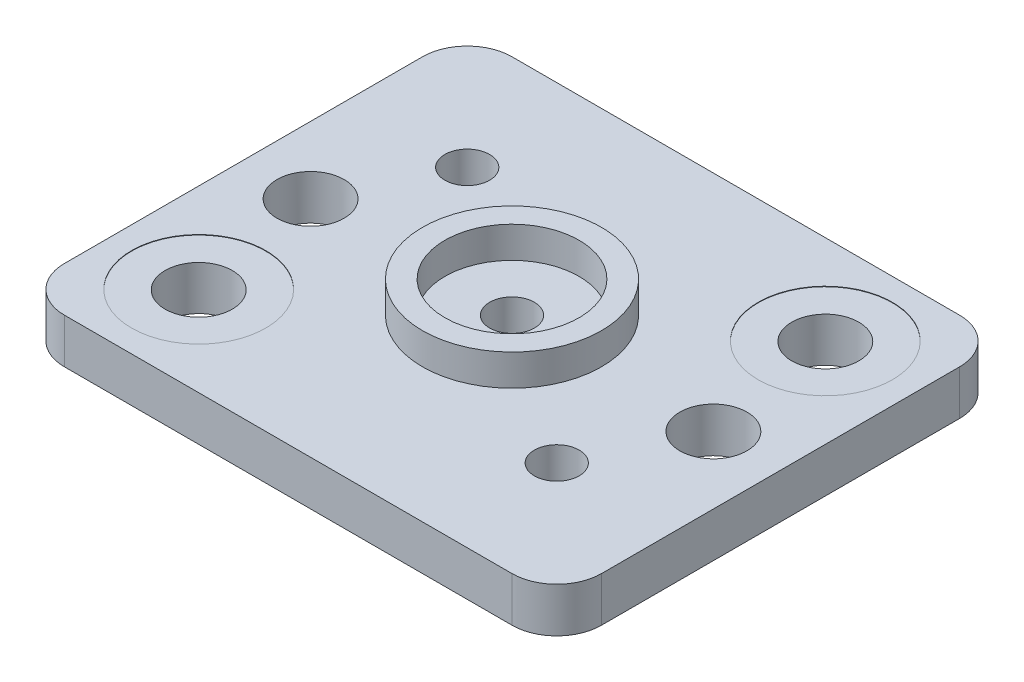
from build123d import *

# Parameters (mm, degrees)
SALIENTE_EXTRUIR1_DEPTH = 1
REDONDEO1_R             = 1
CROQUIS2_R              = 1.5
CORTAR_EXTRUIR3_DEPTH   = 0.01
CROQUIS5_R              = 0.75
CORTAR_EXTRUIR5_DEPTH   = 1.1
CROQUIS6_R              = 0.75
CROQUIS6_R_2            = 0.5
CORTAR_EXTRUIR6_DEPTH   = 1.1
CROQUIS7_R              = 2
SALIENTE_EXTRUIR2_DEPTH = 0.7
CROQUIS8_R              = 1.5
CORTAR_EXTRUIR7_DEPTH   = 0.7
CROQUIS9_R              = 0.5
CORTAR_EXTRUIR9_DEPTH   = 8


with BuildPart() as part:
    # Croquis1 → Saliente-Extruir1 (new body)
    with BuildSketch(Plane(origin=(0, 0, 0), x_dir=(1, 0, 0), z_dir=(0, 1, 0))):
        Polygon((-6, 5), (6, 5), (6, 0.5), (6, -5), (1.5, -5), (-6, -5), align=None)
    extrude(amount=SALIENTE_EXTRUIR1_DEPTH)

    # Redondeo1
    redondeo1_edges = [part.edges().sort_by_distance(p)[0] for p in [
        (-6, 0.5, -5),
        (6, 0.5, -5),
        (6, 0.5, 5),
        (-6, 0.5, 5),
    ]]
    fillet(redondeo1_edges, radius=REDONDEO1_R)

    # Croquis2 → Cortar-Extruir3 (cut)
    with BuildSketch(Plane(origin=(0, 1, 0), x_dir=(1, 0, 0), z_dir=(0, 1, 0))):
        with Locations(Location((4, 3, 0), (0, 0, 270))):
            Circle(CROQUIS2_R)
        with Locations(Location((-4, -3, 0), (0, 0, 270))):
            Circle(CROQUIS2_R)
    extrude(amount=-CORTAR_EXTRUIR3_DEPTH, mode=Mode.SUBTRACT)

    # Croquis5 → Cortar-Extruir5 (cut)
    with BuildSketch(Plane(origin=(0, 0.99, 0), x_dir=(1, 0, 0), z_dir=(0, 1, 0))):
        with Locations(Location((4, 3, 0), (0, 0, 270))):
            Circle(CROQUIS5_R)
        with Locations(Location((-4, -3, 0), (0, 0, 270))):
            Circle(CROQUIS5_R)
    extrude(amount=-CORTAR_EXTRUIR5_DEPTH, mode=Mode.SUBTRACT)

    # Croquis6 → Cortar-Extruir6 (cut)
    with BuildSketch(Plane(origin=(0, 1, 0), x_dir=(1, 0, 0), z_dir=(0, 1, 0))):
        with Locations(Location((4.5, 0, 0), (0, 0, 270))):
            Circle(CROQUIS6_R)
        with Locations(Location((-4.5, 0, 0), (0, 0, 270))):
            Circle(CROQUIS6_R)
        with Locations(Location((3.36, -2.36, 0), (0, 0, 270))):
            Circle(CROQUIS6_R_2)
        with Locations(Location((-3.36, 2.36, 0), (0, 0, 270))):
            Circle(CROQUIS6_R_2)
    extrude(amount=-CORTAR_EXTRUIR6_DEPTH, mode=Mode.SUBTRACT)

    # Croquis7 → Saliente-Extruir2 (add)
    with BuildSketch(Plane(origin=(0, 1, 0), x_dir=(1, 0, 0), z_dir=(0, 1, 0))):
        with Locations(Location((0, 0, 0), (0, 0, 270))):
            Circle(CROQUIS7_R)
    extrude(amount=SALIENTE_EXTRUIR2_DEPTH)

    # Croquis8 → Cortar-Extruir7 (cut)
    with BuildSketch(Plane(origin=(0, 1.7, 0), x_dir=(1, 0, 0), z_dir=(0, 1, 0))):
        with Locations(Location((0, 0, 0), (0, 0, 270))):
            Circle(CROQUIS8_R)
    extrude(amount=-CORTAR_EXTRUIR7_DEPTH, mode=Mode.SUBTRACT)

    # Croquis9 → Cortar-Extruir9 (cut)
    with BuildSketch(Plane(origin=(0, 1, 0), x_dir=(1, 0, 0), z_dir=(0, 1, 0))):
        with Locations(Location((0, 0, 0), (0, 0, 270))):
            Circle(CROQUIS9_R)
    extrude(amount=-CORTAR_EXTRUIR9_DEPTH, mode=Mode.SUBTRACT)


solid = part.part
